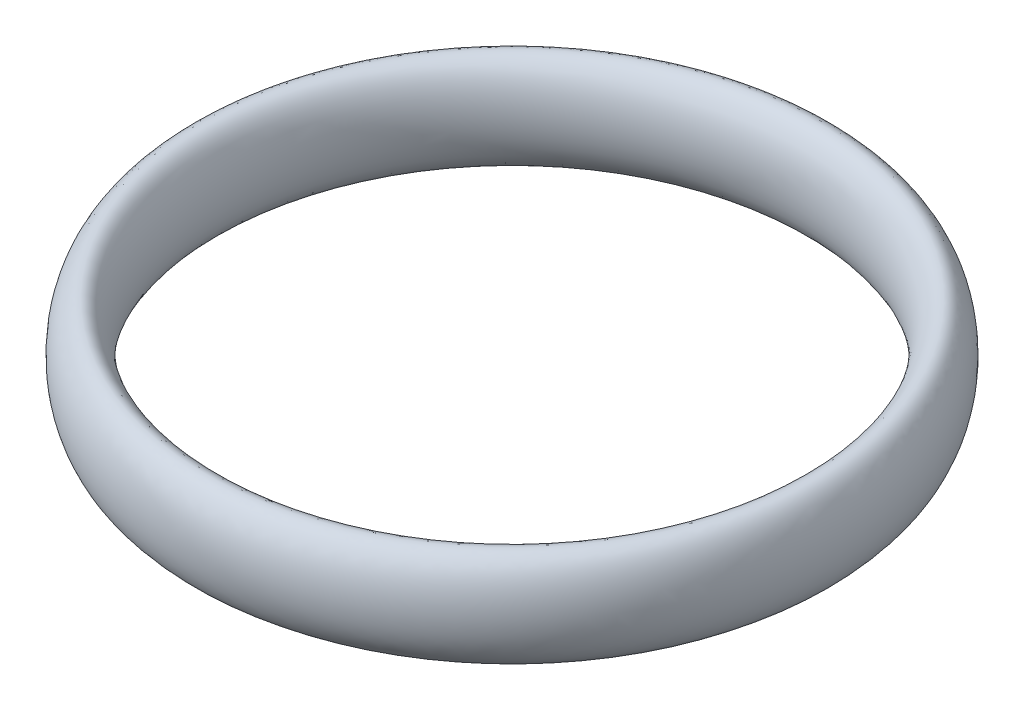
from build123d import *

# Parameters (mm, degrees)
SKETCH1_RX = 1.016
SKETCH1_RY = 0.508


with BuildPart() as part:
    # Sketch1 → Body (revolve)
    with BuildSketch(Plane.XY):
        with Locations(Location((6.35, 1.016), (0, 0, 90))):
            Ellipse(SKETCH1_RX, SKETCH1_RY)
    revolve(axis=Axis((0, 0, 0), (0, 1, 0)))


solid = part.part
